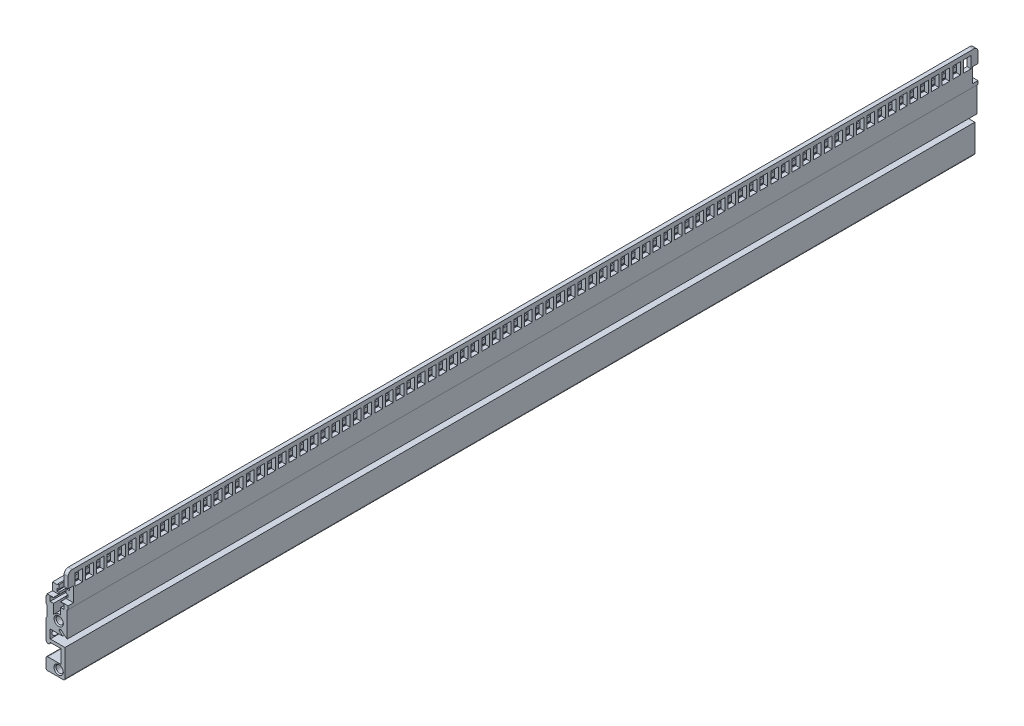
from build123d import *

# Parameters (mm, degrees)
SKETCH_1_R          = 1.7
EXTRUDE_1_DEPTH     = 431.8
FILLET_1_R          = 2
SKETCH_2_W          = 3.6
SKETCH_2_H          = 5.5
CUT_EXTRUDE_1_DEPTH = 1.9
SKETCH_3_W          = 2.54
SKETCH_3_H          = 7
CUT_EXTRUDE_2_DEPTH = 433.539582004
SKETCH_4_R          = 1.65
CUT_EXTRUDE_3_DEPTH = 2
CHAMFER_1_SIZE      = 0.5
CHAMFER_2_SIZE      = 0.5


with BuildPart() as part:
    # Sketch 1 → Extrude 1 (new body)
    with BuildSketch(Plane.XY):
        with BuildLine():
            Line((2.6, 12.5), (2.6, 22.5))
            Line((2.6, 22.5), (4.5, 22.5))
            Line((4.5, 22.5), (4.5, 6.95))
            Line((4.5, 6.95), (4, 6.45))
            Line((4, 6.45), (4, -5.445811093))
            Line((4, -5.445811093), (1.222426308, -3.115150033))
            ThreePointArc((1.222426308, -3.115150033), (0.377127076, -3.189104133), (0.451081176, -4.034403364))
            Line((0.451081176, -4.034403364), (1.899772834, -5.25))
            Line((1.899772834, -5.25), (-4, -5.25))
            Line((-4, -5.25), (-4, -9.35))
            Line((-4, -9.35), (3, -9.35))
            Line((3, -9.35), (3, -22.2))
            ThreePointArc((3, -22.2), (2.765685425, -22.765685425), (2.2, -23))
            Line((2.2, -23), (-5.2, -23))
            ThreePointArc((-5.2, -23), (-5.765685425, -22.765685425), (-6, -22.2))
            Line((-6, -22.2), (-6, -18.05))
            ThreePointArc((-6, -18.05), (-5.765685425, -17.484314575), (-5.2, -17.25))
            Line((-5.2, -17.25), (1, -17.25))
            Line((1, -17.25), (1, -10.75))
            Line((1, -10.75), (-4, -10.75))
            ThreePointArc((-4, -10.75), (-5, -11.75), (-6, -10.75))
            Line((-6, -10.75), (-6, -1.6))
            Line((-6, -1.6), (-5.550132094, -1.100195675))
            Line((-5.550132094, -1.100195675), (-5.549867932, 3.899804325))
            Line((-5.549867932, 3.899804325), (-6, 4.4))
            Line((-6, 4.4), (-6, 7.4))
            Line((-6, 7.4), (-5.7, 7.7))
            Line((-5.7, 7.7), (-5.45, 7.7))
            Line((-5.45, 7.7), (-5.45, 12.1))
            Line((-5.45, 12.1), (-3, 12.1))
            Line((-3, 12.1), (-3, 12.5))
            Line((-3, 12.5), (-2.45, 12.5))
            Line((-2.45, 12.5), (-2.45, 10.55))
            Line((-2.45, 10.55), (-3.35, 10.55))
            Line((-3.35, 10.55), (-3.35, 9.35))
            Line((-3.35, 9.35), (-2.45, 9.35))
            Line((-2.45, 9.35), (-2.45, 8.35))
            Line((-2.45, 8.35), (-4.05, 8.35))
            Line((-4.05, 8.35), (-4.05, 6.05))
            Line((-4.05, 6.05), (-2.45, 6.05))
            Line((-2.45, 6.05), (-2.45, 1.307669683))
            ThreePointArc((-2.45, 1.307669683), (-1.033604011, 2.711523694), (0.95, 2.917190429))
            Line((0.95, 2.917190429), (0.95, 6.05))
            Line((0.95, 6.05), (2.55, 6.05))
            Line((2.55, 6.05), (2.55, 8.35))
            Line((2.55, 8.35), (0.95, 8.35))
            Line((0.95, 8.35), (0.95, 9.35))
            Line((0.95, 9.35), (1.85, 9.35))
            Line((1.85, 9.35), (1.85, 10.55))
            Line((1.85, 10.55), (0.95, 10.55))
            Line((0.95, 10.55), (0.95, 12.5))
            Line((0.95, 12.5), (2.6, 12.5))
        make_face()
        Circle(SKETCH_1_R, mode=Mode.SUBTRACT)
        with Locations((0, -20)):
            Circle(SKETCH_1_R, mode=Mode.SUBTRACT)
    extrude(amount=-EXTRUDE_1_DEPTH)

    # Fillet 1
    fillet_1_edges = [part.edges().sort_by_distance(p)[0] for p in [
        (3.55, 22.5, -431.8),
        (3.55, 22.5, 0),
    ]]
    fillet(fillet_1_edges, radius=FILLET_1_R)

    # Sketch 2 → Cut-Extrude 1 (cut)
    with BuildSketch(Plane(origin=(4.5, 0, 0), x_dir=(0, 0, -1), z_dir=(1, 0, 0))):
        with Locations((10.16, 17.7)):
            Rectangle(SKETCH_2_W, SKETCH_2_H)
        with Locations((5.08, 17.7)):
            Rectangle(SKETCH_2_W, SKETCH_2_H)
        with Locations((15.24, 17.7)):
            Rectangle(SKETCH_2_W, SKETCH_2_H)
        with Locations((20.32, 17.7)):
            Rectangle(SKETCH_2_W, SKETCH_2_H)
        with Locations((25.4, 17.7)):
            Rectangle(SKETCH_2_W, SKETCH_2_H)
        with Locations((30.48, 17.7)):
            Rectangle(SKETCH_2_W, SKETCH_2_H)
        with Locations((35.56, 17.7)):
            Rectangle(SKETCH_2_W, SKETCH_2_H)
        with Locations((40.64, 17.7)):
            Rectangle(SKETCH_2_W, SKETCH_2_H)
        with Locations((45.72, 17.7)):
            Rectangle(SKETCH_2_W, SKETCH_2_H)
        with Locations((50.8, 17.7)):
            Rectangle(SKETCH_2_W, SKETCH_2_H)
        with Locations((55.88, 17.7)):
            Rectangle(SKETCH_2_W, SKETCH_2_H)
        with Locations((60.96, 17.7)):
            Rectangle(SKETCH_2_W, SKETCH_2_H)
        with Locations((66.04, 17.7)):
            Rectangle(SKETCH_2_W, SKETCH_2_H)
        with Locations((71.12, 17.7)):
            Rectangle(SKETCH_2_W, SKETCH_2_H)
        with Locations((76.2, 17.7)):
            Rectangle(SKETCH_2_W, SKETCH_2_H)
        with Locations((81.28, 17.7)):
            Rectangle(SKETCH_2_W, SKETCH_2_H)
        with Locations((86.36, 17.7)):
            Rectangle(SKETCH_2_W, SKETCH_2_H)
        with Locations((91.44, 17.7)):
            Rectangle(SKETCH_2_W, SKETCH_2_H)
        with Locations((96.52, 17.7)):
            Rectangle(SKETCH_2_W, SKETCH_2_H)
        with Locations((101.6, 17.7)):
            Rectangle(SKETCH_2_W, SKETCH_2_H)
        with Locations((106.68, 17.7)):
            Rectangle(SKETCH_2_W, SKETCH_2_H)
        with Locations((111.76, 17.7)):
            Rectangle(SKETCH_2_W, SKETCH_2_H)
        with Locations((116.84, 17.7)):
            Rectangle(SKETCH_2_W, SKETCH_2_H)
        with Locations((121.92, 17.7)):
            Rectangle(SKETCH_2_W, SKETCH_2_H)
        with Locations((127, 17.7)):
            Rectangle(SKETCH_2_W, SKETCH_2_H)
        with Locations((132.08, 17.7)):
            Rectangle(SKETCH_2_W, SKETCH_2_H)
        with Locations((137.16, 17.7)):
            Rectangle(SKETCH_2_W, SKETCH_2_H)
        with Locations((142.24, 17.7)):
            Rectangle(SKETCH_2_W, SKETCH_2_H)
        with Locations((147.32, 17.7)):
            Rectangle(SKETCH_2_W, SKETCH_2_H)
        with Locations((152.4, 17.7)):
            Rectangle(SKETCH_2_W, SKETCH_2_H)
        with Locations((157.48, 17.7)):
            Rectangle(SKETCH_2_W, SKETCH_2_H)
        with Locations((162.56, 17.7)):
            Rectangle(SKETCH_2_W, SKETCH_2_H)
        with Locations((167.64, 17.7)):
            Rectangle(SKETCH_2_W, SKETCH_2_H)
        with Locations((172.72, 17.7)):
            Rectangle(SKETCH_2_W, SKETCH_2_H)
        with Locations((177.8, 17.7)):
            Rectangle(SKETCH_2_W, SKETCH_2_H)
        with Locations((182.88, 17.7)):
            Rectangle(SKETCH_2_W, SKETCH_2_H)
        with Locations((187.96, 17.7)):
            Rectangle(SKETCH_2_W, SKETCH_2_H)
        with Locations((193.04, 17.7)):
            Rectangle(SKETCH_2_W, SKETCH_2_H)
        with Locations((198.12, 17.7)):
            Rectangle(SKETCH_2_W, SKETCH_2_H)
        with Locations((203.2, 17.7)):
            Rectangle(SKETCH_2_W, SKETCH_2_H)
        with Locations((208.28, 17.7)):
            Rectangle(SKETCH_2_W, SKETCH_2_H)
        with Locations((213.36, 17.7)):
            Rectangle(SKETCH_2_W, SKETCH_2_H)
        with Locations((218.44, 17.7)):
            Rectangle(SKETCH_2_W, SKETCH_2_H)
        with Locations((223.52, 17.7)):
            Rectangle(SKETCH_2_W, SKETCH_2_H)
        with Locations((228.6, 17.7)):
            Rectangle(SKETCH_2_W, SKETCH_2_H)
        with Locations((233.68, 17.7)):
            Rectangle(SKETCH_2_W, SKETCH_2_H)
        with Locations((238.76, 17.7)):
            Rectangle(SKETCH_2_W, SKETCH_2_H)
        with Locations((243.84, 17.7)):
            Rectangle(SKETCH_2_W, SKETCH_2_H)
        with Locations((248.92, 17.7)):
            Rectangle(SKETCH_2_W, SKETCH_2_H)
        with Locations((254, 17.7)):
            Rectangle(SKETCH_2_W, SKETCH_2_H)
        with Locations((259.08, 17.7)):
            Rectangle(SKETCH_2_W, SKETCH_2_H)
        with Locations((264.16, 17.7)):
            Rectangle(SKETCH_2_W, SKETCH_2_H)
        with Locations((269.24, 17.7)):
            Rectangle(SKETCH_2_W, SKETCH_2_H)
        with Locations((274.32, 17.7)):
            Rectangle(SKETCH_2_W, SKETCH_2_H)
        with Locations((279.4, 17.7)):
            Rectangle(SKETCH_2_W, SKETCH_2_H)
        with Locations((284.48, 17.7)):
            Rectangle(SKETCH_2_W, SKETCH_2_H)
        with Locations((289.56, 17.7)):
            Rectangle(SKETCH_2_W, SKETCH_2_H)
        with Locations((294.64, 17.7)):
            Rectangle(SKETCH_2_W, SKETCH_2_H)
        with Locations((299.72, 17.7)):
            Rectangle(SKETCH_2_W, SKETCH_2_H)
        with Locations((304.8, 17.7)):
            Rectangle(SKETCH_2_W, SKETCH_2_H)
        with Locations((309.88, 17.7)):
            Rectangle(SKETCH_2_W, SKETCH_2_H)
        with Locations((314.96, 17.7)):
            Rectangle(SKETCH_2_W, SKETCH_2_H)
        with Locations((320.04, 17.7)):
            Rectangle(SKETCH_2_W, SKETCH_2_H)
        with Locations((325.12, 17.7)):
            Rectangle(SKETCH_2_W, SKETCH_2_H)
        with Locations((330.2, 17.7)):
            Rectangle(SKETCH_2_W, SKETCH_2_H)
        with Locations((335.28, 17.7)):
            Rectangle(SKETCH_2_W, SKETCH_2_H)
        with Locations((340.36, 17.7)):
            Rectangle(SKETCH_2_W, SKETCH_2_H)
        with Locations((345.44, 17.7)):
            Rectangle(SKETCH_2_W, SKETCH_2_H)
        with Locations((350.52, 17.7)):
            Rectangle(SKETCH_2_W, SKETCH_2_H)
        with Locations((355.6, 17.7)):
            Rectangle(SKETCH_2_W, SKETCH_2_H)
        with Locations((360.68, 17.7)):
            Rectangle(SKETCH_2_W, SKETCH_2_H)
        with Locations((365.76, 17.7)):
            Rectangle(SKETCH_2_W, SKETCH_2_H)
        with Locations((370.84, 17.7)):
            Rectangle(SKETCH_2_W, SKETCH_2_H)
        with Locations((375.92, 17.7)):
            Rectangle(SKETCH_2_W, SKETCH_2_H)
        with Locations((381, 17.7)):
            Rectangle(SKETCH_2_W, SKETCH_2_H)
        with Locations((386.08, 17.7)):
            Rectangle(SKETCH_2_W, SKETCH_2_H)
        with Locations((391.16, 17.7)):
            Rectangle(SKETCH_2_W, SKETCH_2_H)
        with Locations((396.24, 17.7)):
            Rectangle(SKETCH_2_W, SKETCH_2_H)
        with Locations((401.32, 17.7)):
            Rectangle(SKETCH_2_W, SKETCH_2_H)
        with Locations((406.4, 17.7)):
            Rectangle(SKETCH_2_W, SKETCH_2_H)
        with Locations((411.48, 17.7)):
            Rectangle(SKETCH_2_W, SKETCH_2_H)
        with Locations((416.56, 17.7)):
            Rectangle(SKETCH_2_W, SKETCH_2_H)
        with Locations((421.64, 17.7)):
            Rectangle(SKETCH_2_W, SKETCH_2_H)
        with Locations((426.72, 17.7)):
            Rectangle(SKETCH_2_W, SKETCH_2_H)
    extrude(amount=-CUT_EXTRUDE_1_DEPTH, mode=Mode.SUBTRACT)

    # Sketch 3 → Cut-Extrude 2 (cut, through all)
    with BuildSketch(Plane(origin=(4.5, 0, 0), x_dir=(0, 0, -1), z_dir=(1, 0, 0))):
        with Locations((1.27, 12)):
            Rectangle(SKETCH_3_W, SKETCH_3_H)
    cut_extrude_2 = extrude(amount=-CUT_EXTRUDE_2_DEPTH, mode=Mode.SUBTRACT)

    # Mirror 1: Cut-Extrude 2 across plane
    add(cut_extrude_2.mirror(Plane.XY.offset(-215.9)), mode=Mode.SUBTRACT)

    # Sketch 4 → Cut-Extrude 3 (cut)
    with BuildSketch(Plane.ZY.offset(6)):
        with Locations((-429.26, -7.45)):
            Circle(SKETCH_4_R)
        with Locations((-424.18, -7.45)):
            Circle(SKETCH_4_R)
        with Locations((-419.1, -7.45)):
            Circle(SKETCH_4_R)
        with Locations((-414.02, -7.45)):
            Circle(SKETCH_4_R)
        with Locations((-408.94, -7.45)):
            Circle(SKETCH_4_R)
        with Locations((-403.86, -7.45)):
            Circle(SKETCH_4_R)
        with Locations((-398.78, -7.45)):
            Circle(SKETCH_4_R)
        with Locations((-393.7, -7.45)):
            Circle(SKETCH_4_R)
        with Locations((-388.62, -7.45)):
            Circle(SKETCH_4_R)
        with Locations((-383.54, -7.45)):
            Circle(SKETCH_4_R)
        with Locations((-378.46, -7.45)):
            Circle(SKETCH_4_R)
        with Locations((-373.38, -7.45)):
            Circle(SKETCH_4_R)
        with Locations((-368.3, -7.45)):
            Circle(SKETCH_4_R)
        with Locations((-363.22, -7.45)):
            Circle(SKETCH_4_R)
        with Locations((-358.14, -7.45)):
            Circle(SKETCH_4_R)
        with Locations((-353.06, -7.45)):
            Circle(SKETCH_4_R)
        with Locations((-347.98, -7.45)):
            Circle(SKETCH_4_R)
        with Locations((-342.9, -7.45)):
            Circle(SKETCH_4_R)
        with Locations((-337.82, -7.45)):
            Circle(SKETCH_4_R)
        with Locations((-332.74, -7.45)):
            Circle(SKETCH_4_R)
        with Locations((-327.66, -7.45)):
            Circle(SKETCH_4_R)
        with Locations((-322.58, -7.45)):
            Circle(SKETCH_4_R)
        with Locations((-317.5, -7.45)):
            Circle(SKETCH_4_R)
        with Locations((-312.42, -7.45)):
            Circle(SKETCH_4_R)
        with Locations((-307.34, -7.45)):
            Circle(SKETCH_4_R)
        with Locations((-302.26, -7.45)):
            Circle(SKETCH_4_R)
        with Locations((-297.18, -7.45)):
            Circle(SKETCH_4_R)
        with Locations((-292.1, -7.45)):
            Circle(SKETCH_4_R)
        with Locations((-287.02, -7.45)):
            Circle(SKETCH_4_R)
        with Locations((-281.94, -7.45)):
            Circle(SKETCH_4_R)
        with Locations((-276.86, -7.45)):
            Circle(SKETCH_4_R)
        with Locations((-271.78, -7.45)):
            Circle(SKETCH_4_R)
        with Locations((-266.7, -7.45)):
            Circle(SKETCH_4_R)
        with Locations((-261.62, -7.45)):
            Circle(SKETCH_4_R)
        with Locations((-256.54, -7.45)):
            Circle(SKETCH_4_R)
        with Locations((-251.46, -7.45)):
            Circle(SKETCH_4_R)
        with Locations((-246.38, -7.45)):
            Circle(SKETCH_4_R)
        with Locations((-241.3, -7.45)):
            Circle(SKETCH_4_R)
        with Locations((-236.22, -7.45)):
            Circle(SKETCH_4_R)
        with Locations((-231.14, -7.45)):
            Circle(SKETCH_4_R)
        with Locations((-226.06, -7.45)):
            Circle(SKETCH_4_R)
        with Locations((-220.98, -7.45)):
            Circle(SKETCH_4_R)
        with Locations((-215.9, -7.45)):
            Circle(SKETCH_4_R)
        with Locations((-210.82, -7.45)):
            Circle(SKETCH_4_R)
        with Locations((-205.74, -7.45)):
            Circle(SKETCH_4_R)
        with Locations((-200.66, -7.45)):
            Circle(SKETCH_4_R)
        with Locations((-195.58, -7.45)):
            Circle(SKETCH_4_R)
        with Locations((-190.5, -7.45)):
            Circle(SKETCH_4_R)
        with Locations((-185.42, -7.45)):
            Circle(SKETCH_4_R)
        with Locations((-180.34, -7.45)):
            Circle(SKETCH_4_R)
        with Locations((-175.26, -7.45)):
            Circle(SKETCH_4_R)
        with Locations((-170.18, -7.45)):
            Circle(SKETCH_4_R)
        with Locations((-165.1, -7.45)):
            Circle(SKETCH_4_R)
        with Locations((-160.02, -7.45)):
            Circle(SKETCH_4_R)
        with Locations((-154.94, -7.45)):
            Circle(SKETCH_4_R)
        with Locations((-149.86, -7.45)):
            Circle(SKETCH_4_R)
        with Locations((-144.78, -7.45)):
            Circle(SKETCH_4_R)
        with Locations((-139.7, -7.45)):
            Circle(SKETCH_4_R)
        with Locations((-134.62, -7.45)):
            Circle(SKETCH_4_R)
        with Locations((-129.54, -7.45)):
            Circle(SKETCH_4_R)
        with Locations((-124.46, -7.45)):
            Circle(SKETCH_4_R)
        with Locations((-119.38, -7.45)):
            Circle(SKETCH_4_R)
        with Locations((-114.3, -7.45)):
            Circle(SKETCH_4_R)
        with Locations((-109.22, -7.45)):
            Circle(SKETCH_4_R)
        with Locations((-104.14, -7.45)):
            Circle(SKETCH_4_R)
        with Locations((-99.06, -7.45)):
            Circle(SKETCH_4_R)
        with Locations((-93.98, -7.45)):
            Circle(SKETCH_4_R)
        with Locations((-88.9, -7.45)):
            Circle(SKETCH_4_R)
        with Locations((-83.82, -7.45)):
            Circle(SKETCH_4_R)
        with Locations((-78.74, -7.45)):
            Circle(SKETCH_4_R)
        with Locations((-73.66, -7.45)):
            Circle(SKETCH_4_R)
        with Locations((-68.58, -7.45)):
            Circle(SKETCH_4_R)
        with Locations((-63.5, -7.45)):
            Circle(SKETCH_4_R)
        with Locations((-58.42, -7.45)):
            Circle(SKETCH_4_R)
        with Locations((-53.34, -7.45)):
            Circle(SKETCH_4_R)
        with Locations((-48.26, -7.45)):
            Circle(SKETCH_4_R)
        with Locations((-43.18, -7.45)):
            Circle(SKETCH_4_R)
        with Locations((-38.1, -7.45)):
            Circle(SKETCH_4_R)
        with Locations((-33.02, -7.45)):
            Circle(SKETCH_4_R)
        with Locations((-27.94, -7.45)):
            Circle(SKETCH_4_R)
        with Locations((-22.86, -7.45)):
            Circle(SKETCH_4_R)
        with Locations((-17.78, -7.45)):
            Circle(SKETCH_4_R)
        with Locations((-12.7, -7.45)):
            Circle(SKETCH_4_R)
        with Locations((-7.62, -7.45)):
            Circle(SKETCH_4_R)
        with Locations((-2.54, -7.45)):
            Circle(SKETCH_4_R)
    extrude(amount=-CUT_EXTRUDE_3_DEPTH, mode=Mode.SUBTRACT)

    # Chamfer 1
    chamfer_1_edges = [part.edges().sort_by_distance(p)[0] for p in [
        (-1.7, 0, -431.8),
        (-1.7, 0, 0),
        (-1.7, -20, 0),
    ]]
    chamfer(chamfer_1_edges, length=CHAMFER_1_SIZE)

    # Chamfer 2
    chamfer_2_edges = [part.edges().sort_by_distance(p)[0] for p in [
        (-1.7, -20, -431.8),
    ]]
    chamfer(chamfer_2_edges, length=CHAMFER_2_SIZE)


solid = part.part
